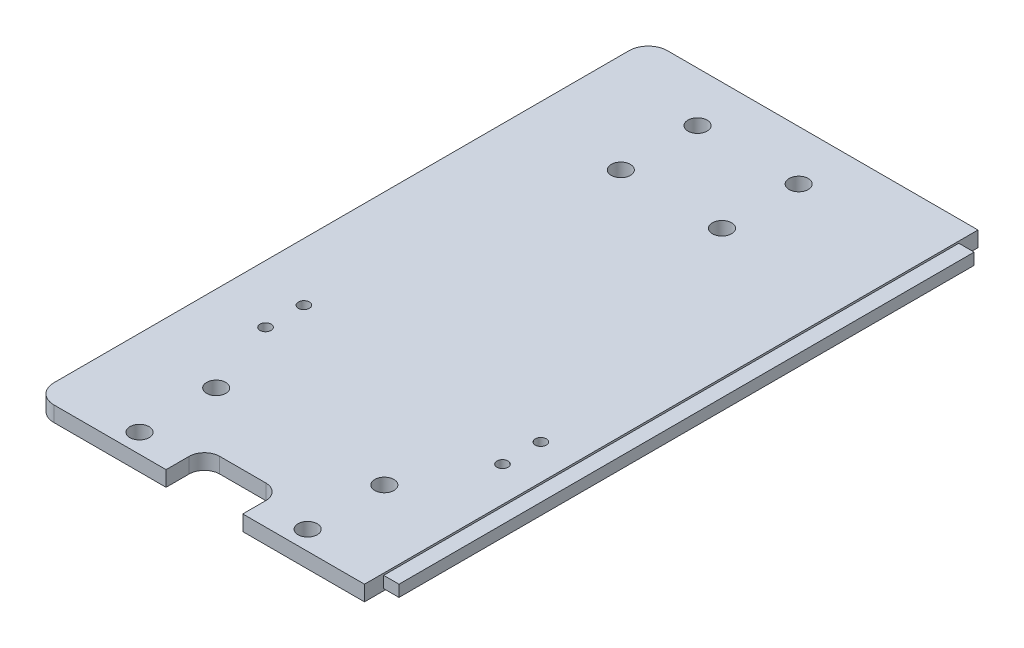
ISO-10303-21;
HEADER;
FILE_DESCRIPTION(('STEP AP214'),'2;1');
FILE_NAME('part.step','',(''),(''),'','','');
FILE_SCHEMA(('AUTOMOTIVE_DESIGN { 1 0 10303 214 1 1 1 1 }'));
ENDSEC;
DATA;
#1=APPLICATION_CONTEXT('core data for automotive mechanical design processes');
#2=APPLICATION_PROTOCOL_DEFINITION('international standard','automotive_design',2000,#1);
#3=PRODUCT_CONTEXT('',#1,'mechanical');
#4=PRODUCT('Part','Part','',(#3));
#5=PRODUCT_RELATED_PRODUCT_CATEGORY('part','',(#4));
#6=PRODUCT_DEFINITION_FORMATION('','',#4);
#7=PRODUCT_DEFINITION_CONTEXT('part definition',#1,'design');
#8=PRODUCT_DEFINITION('design','',#6,#7);
#9=PRODUCT_DEFINITION_SHAPE('','',#8);
#10=(LENGTH_UNIT() NAMED_UNIT(*) SI_UNIT(.MILLI.,.METRE.));
#11=(NAMED_UNIT(*) PLANE_ANGLE_UNIT() SI_UNIT($,.RADIAN.));
#12=(NAMED_UNIT(*) SI_UNIT($,.STERADIAN.) SOLID_ANGLE_UNIT());
#13=UNCERTAINTY_MEASURE_WITH_UNIT(LENGTH_MEASURE(1.E-05),#10,'distance_accuracy_value','');
#14=(GEOMETRIC_REPRESENTATION_CONTEXT(3) GLOBAL_UNCERTAINTY_ASSIGNED_CONTEXT((#13)) GLOBAL_UNIT_ASSIGNED_CONTEXT((#10,
#11,#12)) REPRESENTATION_CONTEXT('',''));
#15=CARTESIAN_POINT('',(0.,0.,0.));
#16=DIRECTION('',(0.,0.,1.));
#17=DIRECTION('',(1.,0.,0.));
#18=AXIS2_PLACEMENT_3D('',#15,#16,#17);
#19=CARTESIAN_POINT('',(109.22,12.7,0.));
#20=DIRECTION('',(-1.,0.,0.));
#21=DIRECTION('',(0.,-1.,0.));
#22=AXIS2_PLACEMENT_3D('',#19,#20,#21);
#23=PLANE('',#22);
#24=DIRECTION('',(0.,1.,0.));
#25=VECTOR('',#24,1.);
#26=CARTESIAN_POINT('',(109.22,0.,203.2));
#27=LINE('',#26,#25);
#28=CARTESIAN_POINT('',(109.22,-2.53999999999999,203.2));
#29=VERTEX_POINT('',#28);
#30=CARTESIAN_POINT('',(109.22,2.54000000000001,203.2));
#31=VERTEX_POINT('',#30);
#32=EDGE_CURVE('E236',#29,#31,#27,.T.);
#33=ORIENTED_EDGE('',*,*,#32,.F.);
#34=DIRECTION('',(0.,0.,-1.));
#35=VECTOR('',#34,1.);
#36=CARTESIAN_POINT('',(109.22,-2.53999999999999,203.2));
#37=LINE('',#36,#35);
#38=CARTESIAN_POINT('',(109.22,-2.53999999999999,0.));
#39=VERTEX_POINT('',#38);
#40=EDGE_CURVE('E184',#39,#29,#37,.F.);
#41=ORIENTED_EDGE('',*,*,#40,.F.);
#42=DIRECTION('',(0.,-1.,0.));
#43=VECTOR('',#42,1.);
#44=CARTESIAN_POINT('',(109.22,12.7,0.));
#45=LINE('',#44,#43);
#46=CARTESIAN_POINT('',(109.22,2.54000000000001,0.));
#47=VERTEX_POINT('',#46);
#48=EDGE_CURVE('E38',#47,#39,#45,.T.);
#49=ORIENTED_EDGE('',*,*,#48,.F.);
#50=DIRECTION('',(0.,0.,-1.));
#51=VECTOR('',#50,1.);
#52=CARTESIAN_POINT('',(109.22,2.54000000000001,-12.7));
#53=LINE('',#52,#51);
#54=EDGE_CURVE('E224',#31,#47,#53,.T.);
#55=ORIENTED_EDGE('',*,*,#54,.F.);
#56=EDGE_LOOP('',(#33,#41,#49,#55));
#57=FACE_BOUND('',#56,.T.);
#58=DIRECTION('',(0.,1.,0.));
#59=VECTOR('',#58,1.);
#60=CARTESIAN_POINT('',(109.22,-1.90499999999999,6.34999999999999));
#61=LINE('',#60,#59);
#62=CARTESIAN_POINT('',(109.22,-1.90499999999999,6.34999999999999));
#63=VERTEX_POINT('',#62);
#64=CARTESIAN_POINT('',(109.22,1.90500000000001,6.35));
#65=VERTEX_POINT('',#64);
#66=EDGE_CURVE('E51',#63,#65,#61,.T.);
#67=ORIENTED_EDGE('',*,*,#66,.F.);
#68=DIRECTION('',(0.,0.,-1.));
#69=VECTOR('',#68,1.);
#70=CARTESIAN_POINT('',(109.22,-1.90499999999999,196.85));
#71=LINE('',#70,#69);
#72=CARTESIAN_POINT('',(109.22,-1.90499999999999,196.85));
#73=VERTEX_POINT('',#72);
#74=EDGE_CURVE('E55',#73,#63,#71,.T.);
#75=ORIENTED_EDGE('',*,*,#74,.F.);
#76=DIRECTION('',(0.,-1.,0.));
#77=VECTOR('',#76,1.);
#78=CARTESIAN_POINT('',(109.22,-1.90499999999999,196.85));
#79=LINE('',#78,#77);
#80=CARTESIAN_POINT('',(109.22,1.90500000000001,196.85));
#81=VERTEX_POINT('',#80);
#82=EDGE_CURVE('E541',#81,#73,#79,.T.);
#83=ORIENTED_EDGE('',*,*,#82,.F.);
#84=DIRECTION('',(0.,0.,1.));
#85=VECTOR('',#84,1.);
#86=CARTESIAN_POINT('',(109.22,1.90500000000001,196.85));
#87=LINE('',#86,#85);
#88=EDGE_CURVE('E547',#65,#81,#87,.T.);
#89=ORIENTED_EDGE('',*,*,#88,.F.);
#90=EDGE_LOOP('',(#67,#75,#83,#89));
#91=FACE_BOUND('',#90,.T.);
#92=ADVANCED_FACE('F35',(#57,#91),#23,.F.);
#93=CARTESIAN_POINT('',(0.,0.,0.));
#94=DIRECTION('',(0.,0.,-1.));
#95=DIRECTION('',(-1.,0.,0.));
#96=AXIS2_PLACEMENT_3D('',#93,#94,#95);
#97=PLANE('',#96);
#98=ORIENTED_EDGE('',*,*,#48,.T.);
#99=DIRECTION('',(1.,0.,0.));
#100=VECTOR('',#99,1.);
#101=CARTESIAN_POINT('',(127.,-2.53999999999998,0.));
#102=LINE('',#101,#100);
#103=CARTESIAN_POINT('',(6.34999999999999,-2.54,0.));
#104=VERTEX_POINT('',#103);
#105=EDGE_CURVE('E223',#104,#39,#102,.T.);
#106=ORIENTED_EDGE('',*,*,#105,.F.);
#107=DIRECTION('',(0.,1.,0.));
#108=VECTOR('',#107,1.);
#109=CARTESIAN_POINT('',(6.35,2.54,0.));
#110=LINE('',#109,#108);
#111=CARTESIAN_POINT('',(6.34999999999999,2.54,0.));
#112=VERTEX_POINT('',#111);
#113=EDGE_CURVE('E170',#104,#112,#110,.T.);
#114=ORIENTED_EDGE('',*,*,#113,.T.);
#115=DIRECTION('',(-1.,0.,0.));
#116=VECTOR('',#115,1.);
#117=CARTESIAN_POINT('',(127.,2.54000000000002,0.));
#118=LINE('',#117,#116);
#119=EDGE_CURVE('E216',#47,#112,#118,.T.);
#120=ORIENTED_EDGE('',*,*,#119,.F.);
#121=EDGE_LOOP('',(#98,#106,#114,#120));
#122=FACE_BOUND('',#121,.T.);
#123=ADVANCED_FACE('F341',(#122),#97,.T.);
#124=CARTESIAN_POINT('',(127.,2.54000000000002,203.2));
#125=DIRECTION('',(0.,-1.,0.));
#126=DIRECTION('',(1.,0.,0.));
#127=AXIS2_PLACEMENT_3D('',#124,#125,#126);
#128=PLANE('',#127);
#129=CARTESIAN_POINT('',(19.144,2.54,133.2));
#130=DIRECTION('',(0.,1.,0.));
#131=DIRECTION('',(-1.,0.,0.));
#132=AXIS2_PLACEMENT_3D('',#129,#130,#131);
#133=CIRCLE('',#132,1.8288);
#134=CARTESIAN_POINT('',(17.3152,2.54000000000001,133.2));
#135=VERTEX_POINT('',#134);
#136=EDGE_CURVE('E235',#135,#135,#133,.T.);
#137=ORIENTED_EDGE('',*,*,#136,.F.);
#138=EDGE_LOOP('',(#137));
#139=FACE_BOUND('',#138,.T.);
#140=CARTESIAN_POINT('',(19.144,2.54,145.9));
#141=DIRECTION('',(0.,1.,0.));
#142=DIRECTION('',(-1.,0.,0.));
#143=AXIS2_PLACEMENT_3D('',#140,#141,#142);
#144=CIRCLE('',#143,1.8288);
#145=CARTESIAN_POINT('',(17.3152,2.54000000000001,145.9));
#146=VERTEX_POINT('',#145);
#147=EDGE_CURVE('E256',#146,#146,#144,.T.);
#148=ORIENTED_EDGE('',*,*,#147,.F.);
#149=EDGE_LOOP('',(#148));
#150=FACE_BOUND('',#149,.T.);
#151=CARTESIAN_POINT('',(97.63,2.54000000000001,145.9));
#152=DIRECTION('',(0.,1.,0.));
#153=DIRECTION('',(-1.,0.,0.));
#154=AXIS2_PLACEMENT_3D('',#151,#152,#153);
#155=CIRCLE('',#154,1.8288);
#156=CARTESIAN_POINT('',(95.8012,2.54000000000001,145.9));
#157=VERTEX_POINT('',#156);
#158=EDGE_CURVE('E252',#157,#157,#155,.T.);
#159=ORIENTED_EDGE('',*,*,#158,.F.);
#160=EDGE_LOOP('',(#159));
#161=FACE_BOUND('',#160,.T.);
#162=CARTESIAN_POINT('',(97.63,2.54000000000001,133.2));
#163=DIRECTION('',(0.,1.,0.));
#164=DIRECTION('',(-1.,0.,0.));
#165=AXIS2_PLACEMENT_3D('',#162,#163,#164);
#166=CIRCLE('',#165,1.8288);
#167=CARTESIAN_POINT('',(95.8012,2.54000000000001,133.2));
#168=VERTEX_POINT('',#167);
#169=EDGE_CURVE('E255',#168,#168,#166,.T.);
#170=ORIENTED_EDGE('',*,*,#169,.F.);
#171=EDGE_LOOP('',(#170));
#172=FACE_BOUND('',#171,.T.);
#173=CARTESIAN_POINT('',(66.33845,2.53999999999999,41.91));
#174=DIRECTION('',(0.,-1.,0.));
#175=DIRECTION('',(1.,0.,0.));
#176=AXIS2_PLACEMENT_3D('',#173,#174,#175);
#177=CIRCLE('',#176,3.175);
#178=CARTESIAN_POINT('',(69.51345,2.53999999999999,41.91));
#179=VERTEX_POINT('',#178);
#180=EDGE_CURVE('E205',#179,#179,#177,.T.);
#181=ORIENTED_EDGE('',*,*,#180,.T.);
#182=EDGE_LOOP('',(#181));
#183=FACE_BOUND('',#182,.T.);
#184=CARTESIAN_POINT('',(66.33845,2.53999999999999,16.51));
#185=DIRECTION('',(0.,-1.,0.));
#186=DIRECTION('',(1.,0.,0.));
#187=AXIS2_PLACEMENT_3D('',#184,#185,#186);
#188=CIRCLE('',#187,3.175);
#189=CARTESIAN_POINT('',(69.51345,2.53999999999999,16.51));
#190=VERTEX_POINT('',#189);
#191=EDGE_CURVE('E266',#190,#190,#188,.T.);
#192=ORIENTED_EDGE('',*,*,#191,.T.);
#193=EDGE_LOOP('',(#192));
#194=FACE_BOUND('',#193,.T.);
#195=CARTESIAN_POINT('',(32.832800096,2.54,41.91));
#196=DIRECTION('',(0.,-1.,0.));
#197=DIRECTION('',(1.,0.,0.));
#198=AXIS2_PLACEMENT_3D('',#195,#196,#197);
#199=CIRCLE('',#198,3.175);
#200=CARTESIAN_POINT('',(36.007800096,2.54,41.91));
#201=VERTEX_POINT('',#200);
#202=EDGE_CURVE('E272',#201,#201,#199,.T.);
#203=ORIENTED_EDGE('',*,*,#202,.T.);
#204=EDGE_LOOP('',(#203));
#205=FACE_BOUND('',#204,.T.);
#206=CARTESIAN_POINT('',(32.832800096,2.54,16.51));
#207=DIRECTION('',(0.,-1.,0.));
#208=DIRECTION('',(1.,0.,0.));
#209=AXIS2_PLACEMENT_3D('',#206,#207,#208);
#210=CIRCLE('',#209,3.175);
#211=CARTESIAN_POINT('',(36.007800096,2.54,16.51));
#212=VERTEX_POINT('',#211);
#213=EDGE_CURVE('E281',#212,#212,#210,.T.);
#214=ORIENTED_EDGE('',*,*,#213,.T.);
#215=EDGE_LOOP('',(#214));
#216=FACE_BOUND('',#215,.T.);
#217=CARTESIAN_POINT('',(84.0486,2.54000000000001,171.45));
#218=DIRECTION('',(0.,1.,0.));
#219=DIRECTION('',(-1.,0.,0.));
#220=AXIS2_PLACEMENT_3D('',#217,#218,#219);
#221=CIRCLE('',#220,3.175);
#222=CARTESIAN_POINT('',(80.8736,2.54000000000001,171.45));
#223=VERTEX_POINT('',#222);
#224=EDGE_CURVE('E275',#223,#223,#221,.T.);
#225=ORIENTED_EDGE('',*,*,#224,.F.);
#226=EDGE_LOOP('',(#225));
#227=FACE_BOUND('',#226,.T.);
#228=CARTESIAN_POINT('',(84.0486,2.54000000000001,196.85));
#229=DIRECTION('',(0.,1.,0.));
#230=DIRECTION('',(-1.,0.,0.));
#231=AXIS2_PLACEMENT_3D('',#228,#229,#230);
#232=CIRCLE('',#231,3.175);
#233=CARTESIAN_POINT('',(80.8736,2.54000000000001,196.85));
#234=VERTEX_POINT('',#233);
#235=EDGE_CURVE('E290',#234,#234,#232,.T.);
#236=ORIENTED_EDGE('',*,*,#235,.F.);
#237=EDGE_LOOP('',(#236));
#238=FACE_BOUND('',#237,.T.);
#239=CARTESIAN_POINT('',(28.3573998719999,2.54,196.85));
#240=DIRECTION('',(0.,-1.,0.));
#241=DIRECTION('',(1.,0.,0.));
#242=AXIS2_PLACEMENT_3D('',#239,#240,#241);
#243=CIRCLE('',#242,3.175);
#244=CARTESIAN_POINT('',(31.5323998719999,2.54,196.85));
#245=VERTEX_POINT('',#244);
#246=EDGE_CURVE('E287',#245,#245,#243,.T.);
#247=ORIENTED_EDGE('',*,*,#246,.T.);
#248=EDGE_LOOP('',(#247));
#249=FACE_BOUND('',#248,.T.);
#250=CARTESIAN_POINT('',(28.3573998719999,2.54,171.45));
#251=DIRECTION('',(0.,-1.,0.));
#252=DIRECTION('',(1.,0.,0.));
#253=AXIS2_PLACEMENT_3D('',#250,#251,#252);
#254=CIRCLE('',#253,3.175);
#255=CARTESIAN_POINT('',(31.5323998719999,2.54,171.45));
#256=VERTEX_POINT('',#255);
#257=EDGE_CURVE('E227',#256,#256,#254,.T.);
#258=ORIENTED_EDGE('',*,*,#257,.T.);
#259=EDGE_LOOP('',(#258));
#260=FACE_BOUND('',#259,.T.);
#261=ORIENTED_EDGE('',*,*,#54,.T.);
#262=ORIENTED_EDGE('',*,*,#119,.T.);
#263=CARTESIAN_POINT('',(6.35,2.54,6.35));
#264=DIRECTION('',(0.,-1.,0.));
#265=DIRECTION('',(1.,0.,0.));
#266=AXIS2_PLACEMENT_3D('',#263,#264,#265);
#267=CIRCLE('',#266,6.35);
#268=CARTESIAN_POINT('',(0.,2.54,6.34999999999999));
#269=VERTEX_POINT('',#268);
#270=EDGE_CURVE('E214',#112,#269,#267,.F.);
#271=ORIENTED_EDGE('',*,*,#270,.T.);
#272=DIRECTION('',(0.,0.,-1.));
#273=VECTOR('',#272,1.);
#274=CARTESIAN_POINT('',(0.,2.54,203.2));
#275=LINE('',#274,#273);
#276=CARTESIAN_POINT('',(0.,2.54,196.85));
#277=VERTEX_POINT('',#276);
#278=EDGE_CURVE('E43',#277,#269,#275,.T.);
#279=ORIENTED_EDGE('',*,*,#278,.F.);
#280=CARTESIAN_POINT('',(6.35,2.54,196.85));
#281=DIRECTION('',(0.,-1.,0.));
#282=DIRECTION('',(1.,0.,0.));
#283=AXIS2_PLACEMENT_3D('',#280,#281,#282);
#284=CIRCLE('',#283,6.35);
#285=CARTESIAN_POINT('',(6.34999999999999,2.54,203.2));
#286=VERTEX_POINT('',#285);
#287=EDGE_CURVE('E182',#277,#286,#284,.F.);
#288=ORIENTED_EDGE('',*,*,#287,.T.);
#289=DIRECTION('',(-1.,0.,0.));
#290=VECTOR('',#289,1.);
#291=CARTESIAN_POINT('',(127.,2.54000000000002,203.2));
#292=LINE('',#291,#290);
#293=CARTESIAN_POINT('',(43.502999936,2.54000000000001,203.2));
#294=VERTEX_POINT('',#293);
#295=EDGE_CURVE('E186',#294,#286,#292,.T.);
#296=ORIENTED_EDGE('',*,*,#295,.F.);
#297=DIRECTION('',(0.,0.,1.));
#298=VECTOR('',#297,1.);
#299=CARTESIAN_POINT('',(43.502999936,2.54000000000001,203.2));
#300=LINE('',#299,#298);
#301=CARTESIAN_POINT('',(43.502999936,2.54000000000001,195.58));
#302=VERTEX_POINT('',#301);
#303=EDGE_CURVE('E190',#302,#294,#300,.T.);
#304=ORIENTED_EDGE('',*,*,#303,.F.);
#305=CARTESIAN_POINT('',(48.582999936,2.54000000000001,195.58));
#306=DIRECTION('',(0.,-1.,0.));
#307=DIRECTION('',(1.,0.,0.));
#308=AXIS2_PLACEMENT_3D('',#305,#306,#307);
#309=CIRCLE('',#308,5.08);
#310=CARTESIAN_POINT('',(48.582999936,2.54000000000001,190.5));
#311=VERTEX_POINT('',#310);
#312=EDGE_CURVE('E179',#302,#311,#309,.T.);
#313=ORIENTED_EDGE('',*,*,#312,.T.);
#314=DIRECTION('',(-1.,0.,0.));
#315=VECTOR('',#314,1.);
#316=CARTESIAN_POINT('',(43.502999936,2.54000000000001,190.5));
#317=LINE('',#316,#315);
#318=CARTESIAN_POINT('',(63.822999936,2.54000000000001,190.5));
#319=VERTEX_POINT('',#318);
#320=EDGE_CURVE('E199',#319,#311,#317,.T.);
#321=ORIENTED_EDGE('',*,*,#320,.F.);
#322=CARTESIAN_POINT('',(63.822999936,2.54000000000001,195.58));
#323=DIRECTION('',(0.,-1.,0.));
#324=DIRECTION('',(1.,0.,0.));
#325=AXIS2_PLACEMENT_3D('',#322,#323,#324);
#326=CIRCLE('',#325,5.08);
#327=CARTESIAN_POINT('',(68.902999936,2.54000000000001,195.58));
#328=VERTEX_POINT('',#327);
#329=EDGE_CURVE('E181',#319,#328,#326,.T.);
#330=ORIENTED_EDGE('',*,*,#329,.T.);
#331=DIRECTION('',(0.,0.,-1.));
#332=VECTOR('',#331,1.);
#333=CARTESIAN_POINT('',(68.902999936,2.54000000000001,203.2));
#334=LINE('',#333,#332);
#335=CARTESIAN_POINT('',(68.902999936,2.54000000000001,203.2));
#336=VERTEX_POINT('',#335);
#337=EDGE_CURVE('E195',#336,#328,#334,.T.);
#338=ORIENTED_EDGE('',*,*,#337,.F.);
#339=EDGE_CURVE('E233',#31,#336,#292,.T.);
#340=ORIENTED_EDGE('',*,*,#339,.F.);
#341=EDGE_LOOP('',(#261,#262,#271,#279,#288,#296,#304,#313,#321,#330,#338,#340));
#342=FACE_BOUND('',#341,.T.);
#343=ADVANCED_FACE('F344',(#139,#150,#161,#172,#183,#194,#205,#216,#227,#238,#249,#260,#342),
#128,.F.);
#344=CARTESIAN_POINT('',(0.,0.,203.2));
#345=DIRECTION('',(0.,0.,-1.));
#346=DIRECTION('',(-1.,0.,0.));
#347=AXIS2_PLACEMENT_3D('',#344,#345,#346);
#348=PLANE('',#347);
#349=ORIENTED_EDGE('',*,*,#295,.T.);
#350=DIRECTION('',(0.,1.,0.));
#351=VECTOR('',#350,1.);
#352=CARTESIAN_POINT('',(6.35,0.,203.2));
#353=LINE('',#352,#351);
#354=CARTESIAN_POINT('',(6.34999999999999,-2.54,203.2));
#355=VERTEX_POINT('',#354);
#356=EDGE_CURVE('E210',#286,#355,#353,.F.);
#357=ORIENTED_EDGE('',*,*,#356,.T.);
#358=DIRECTION('',(1.,0.,0.));
#359=VECTOR('',#358,1.);
#360=CARTESIAN_POINT('',(127.,-2.53999999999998,203.2));
#361=LINE('',#360,#359);
#362=CARTESIAN_POINT('',(43.502999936,-2.53999999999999,203.2));
#363=VERTEX_POINT('',#362);
#364=EDGE_CURVE('E212',#355,#363,#361,.T.);
#365=ORIENTED_EDGE('',*,*,#364,.T.);
#366=DIRECTION('',(0.,1.,0.));
#367=VECTOR('',#366,1.);
#368=CARTESIAN_POINT('',(43.502999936,-2.54100000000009,203.2));
#369=LINE('',#368,#367);
#370=EDGE_CURVE('E232',#363,#294,#369,.T.);
#371=ORIENTED_EDGE('',*,*,#370,.T.);
#372=EDGE_LOOP('',(#349,#357,#365,#371));
#373=FACE_BOUND('',#372,.T.);
#374=ADVANCED_FACE('F370',(#373),#348,.F.);
#375=CARTESIAN_POINT('',(127.,-2.53999999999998,203.2));
#376=DIRECTION('',(0.,1.,0.));
#377=DIRECTION('',(-1.,0.,0.));
#378=AXIS2_PLACEMENT_3D('',#375,#376,#377);
#379=PLANE('',#378);
#380=ORIENTED_EDGE('',*,*,#105,.T.);
#381=ORIENTED_EDGE('',*,*,#40,.T.);
#382=CARTESIAN_POINT('',(68.902999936,-2.53999999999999,203.2));
#383=VERTEX_POINT('',#382);
#384=EDGE_CURVE('E238',#383,#29,#361,.T.);
#385=ORIENTED_EDGE('',*,*,#384,.F.);
#386=DIRECTION('',(0.,0.,1.));
#387=VECTOR('',#386,1.);
#388=CARTESIAN_POINT('',(68.902999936,-2.53999999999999,203.2));
#389=LINE('',#388,#387);
#390=CARTESIAN_POINT('',(68.902999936,-2.53999999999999,195.58));
#391=VERTEX_POINT('',#390);
#392=EDGE_CURVE('E194',#391,#383,#389,.T.);
#393=ORIENTED_EDGE('',*,*,#392,.F.);
#394=CARTESIAN_POINT('',(63.822999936,-2.53999999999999,195.58));
#395=DIRECTION('',(0.,1.,0.));
#396=DIRECTION('',(-1.,0.,0.));
#397=AXIS2_PLACEMENT_3D('',#394,#395,#396);
#398=CIRCLE('',#397,5.08);
#399=CARTESIAN_POINT('',(63.822999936,-2.53999999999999,190.5));
#400=VERTEX_POINT('',#399);
#401=EDGE_CURVE('E178',#391,#400,#398,.T.);
#402=ORIENTED_EDGE('',*,*,#401,.T.);
#403=DIRECTION('',(1.,0.,0.));
#404=VECTOR('',#403,1.);
#405=CARTESIAN_POINT('',(43.502999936,-2.53999999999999,190.5));
#406=LINE('',#405,#404);
#407=CARTESIAN_POINT('',(48.582999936,-2.53999999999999,190.5));
#408=VERTEX_POINT('',#407);
#409=EDGE_CURVE('E200',#408,#400,#406,.T.);
#410=ORIENTED_EDGE('',*,*,#409,.F.);
#411=CARTESIAN_POINT('',(48.582999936,-2.53999999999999,195.58));
#412=DIRECTION('',(0.,1.,0.));
#413=DIRECTION('',(-1.,0.,0.));
#414=AXIS2_PLACEMENT_3D('',#411,#412,#413);
#415=CIRCLE('',#414,5.08);
#416=CARTESIAN_POINT('',(43.502999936,-2.53999999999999,195.58));
#417=VERTEX_POINT('',#416);
#418=EDGE_CURVE('E175',#408,#417,#415,.T.);
#419=ORIENTED_EDGE('',*,*,#418,.T.);
#420=DIRECTION('',(0.,0.,-1.));
#421=VECTOR('',#420,1.);
#422=CARTESIAN_POINT('',(43.502999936,-2.53999999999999,203.2));
#423=LINE('',#422,#421);
#424=EDGE_CURVE('E191',#363,#417,#423,.T.);
#425=ORIENTED_EDGE('',*,*,#424,.F.);
#426=ORIENTED_EDGE('',*,*,#364,.F.);
#427=CARTESIAN_POINT('',(6.35,-2.54,196.85));
#428=DIRECTION('',(0.,1.,0.));
#429=DIRECTION('',(-1.,0.,0.));
#430=AXIS2_PLACEMENT_3D('',#427,#428,#429);
#431=CIRCLE('',#430,6.35);
#432=CARTESIAN_POINT('',(0.,-2.54,196.85));
#433=VERTEX_POINT('',#432);
#434=EDGE_CURVE('E177',#355,#433,#431,.F.);
#435=ORIENTED_EDGE('',*,*,#434,.T.);
#436=DIRECTION('',(0.,0.,1.));
#437=VECTOR('',#436,1.);
#438=CARTESIAN_POINT('',(0.,-2.54,203.2));
#439=LINE('',#438,#437);
#440=CARTESIAN_POINT('',(0.,-2.54,6.34999999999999));
#441=VERTEX_POINT('',#440);
#442=EDGE_CURVE('E219',#441,#433,#439,.T.);
#443=ORIENTED_EDGE('',*,*,#442,.F.);
#444=CARTESIAN_POINT('',(6.35,-2.54,6.35));
#445=DIRECTION('',(0.,1.,0.));
#446=DIRECTION('',(-1.,0.,0.));
#447=AXIS2_PLACEMENT_3D('',#444,#445,#446);
#448=CIRCLE('',#447,6.35);
#449=EDGE_CURVE('E207',#441,#104,#448,.F.);
#450=ORIENTED_EDGE('',*,*,#449,.T.);
#451=EDGE_LOOP('',(#380,#381,#385,#393,#402,#410,#419,#425,#426,#435,#443,#450));
#452=FACE_BOUND('',#451,.T.);
#453=CARTESIAN_POINT('',(28.3573998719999,-2.54,171.45));
#454=DIRECTION('',(0.,1.,0.));
#455=DIRECTION('',(-1.,0.,0.));
#456=AXIS2_PLACEMENT_3D('',#453,#454,#455);
#457=CIRCLE('',#456,3.175);
#458=CARTESIAN_POINT('',(25.182399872,-2.54,171.45));
#459=VERTEX_POINT('',#458);
#460=EDGE_CURVE('E209',#459,#459,#457,.T.);
#461=ORIENTED_EDGE('',*,*,#460,.T.);
#462=EDGE_LOOP('',(#461));
#463=FACE_BOUND('',#462,.T.);
#464=CARTESIAN_POINT('',(28.3573998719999,-2.54,196.85));
#465=DIRECTION('',(0.,1.,0.));
#466=DIRECTION('',(-1.,0.,0.));
#467=AXIS2_PLACEMENT_3D('',#464,#465,#466);
#468=CIRCLE('',#467,3.175);
#469=CARTESIAN_POINT('',(25.182399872,-2.54,196.85));
#470=VERTEX_POINT('',#469);
#471=EDGE_CURVE('E298',#470,#470,#468,.T.);
#472=ORIENTED_EDGE('',*,*,#471,.T.);
#473=EDGE_LOOP('',(#472));
#474=FACE_BOUND('',#473,.T.);
#475=CARTESIAN_POINT('',(84.0486,-2.54000000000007,196.85));
#476=DIRECTION('',(0.,1.,0.));
#477=DIRECTION('',(-1.,0.,0.));
#478=AXIS2_PLACEMENT_3D('',#475,#476,#477);
#479=CIRCLE('',#478,3.175);
#480=CARTESIAN_POINT('',(80.8736,-2.54000000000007,196.85));
#481=VERTEX_POINT('',#480);
#482=EDGE_CURVE('E293',#481,#481,#479,.T.);
#483=ORIENTED_EDGE('',*,*,#482,.T.);
#484=EDGE_LOOP('',(#483));
#485=FACE_BOUND('',#484,.T.);
#486=CARTESIAN_POINT('',(84.0486,-2.54000000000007,171.45));
#487=DIRECTION('',(0.,1.,0.));
#488=DIRECTION('',(-1.,0.,0.));
#489=AXIS2_PLACEMENT_3D('',#486,#487,#488);
#490=CIRCLE('',#489,3.175);
#491=CARTESIAN_POINT('',(80.8736,-2.54000000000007,171.45));
#492=VERTEX_POINT('',#491);
#493=EDGE_CURVE('E284',#492,#492,#490,.T.);
#494=ORIENTED_EDGE('',*,*,#493,.T.);
#495=EDGE_LOOP('',(#494));
#496=FACE_BOUND('',#495,.T.);
#497=CARTESIAN_POINT('',(32.832800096,-2.54,16.51));
#498=DIRECTION('',(0.,1.,0.));
#499=DIRECTION('',(-1.,0.,0.));
#500=AXIS2_PLACEMENT_3D('',#497,#498,#499);
#501=CIRCLE('',#500,3.175);
#502=CARTESIAN_POINT('',(29.657800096,-2.54,16.51));
#503=VERTEX_POINT('',#502);
#504=EDGE_CURVE('E278',#503,#503,#501,.T.);
#505=ORIENTED_EDGE('',*,*,#504,.T.);
#506=EDGE_LOOP('',(#505));
#507=FACE_BOUND('',#506,.T.);
#508=CARTESIAN_POINT('',(32.832800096,-2.54,41.91));
#509=DIRECTION('',(0.,1.,0.));
#510=DIRECTION('',(-1.,0.,0.));
#511=AXIS2_PLACEMENT_3D('',#508,#509,#510);
#512=CIRCLE('',#511,3.175);
#513=CARTESIAN_POINT('',(29.657800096,-2.54,41.91));
#514=VERTEX_POINT('',#513);
#515=EDGE_CURVE('E243',#514,#514,#512,.T.);
#516=ORIENTED_EDGE('',*,*,#515,.T.);
#517=EDGE_LOOP('',(#516));
#518=FACE_BOUND('',#517,.T.);
#519=CARTESIAN_POINT('',(66.33845,-2.54000000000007,16.51));
#520=DIRECTION('',(0.,-1.,0.));
#521=DIRECTION('',(1.,0.,0.));
#522=AXIS2_PLACEMENT_3D('',#519,#520,#521);
#523=CIRCLE('',#522,3.175);
#524=CARTESIAN_POINT('',(69.51345,-2.54000000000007,16.51));
#525=VERTEX_POINT('',#524);
#526=EDGE_CURVE('E269',#525,#525,#523,.T.);
#527=ORIENTED_EDGE('',*,*,#526,.F.);
#528=EDGE_LOOP('',(#527));
#529=FACE_BOUND('',#528,.T.);
#530=CARTESIAN_POINT('',(66.33845,-2.54000000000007,41.91));
#531=DIRECTION('',(0.,-1.,0.));
#532=DIRECTION('',(1.,0.,0.));
#533=AXIS2_PLACEMENT_3D('',#530,#531,#532);
#534=CIRCLE('',#533,3.175);
#535=CARTESIAN_POINT('',(69.51345,-2.54000000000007,41.91));
#536=VERTEX_POINT('',#535);
#537=EDGE_CURVE('E259',#536,#536,#534,.T.);
#538=ORIENTED_EDGE('',*,*,#537,.F.);
#539=EDGE_LOOP('',(#538));
#540=FACE_BOUND('',#539,.T.);
#541=CARTESIAN_POINT('',(97.63,-2.53999999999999,133.2));
#542=DIRECTION('',(0.,1.,0.));
#543=DIRECTION('',(-1.,0.,0.));
#544=AXIS2_PLACEMENT_3D('',#541,#542,#543);
#545=CIRCLE('',#544,1.8288);
#546=CARTESIAN_POINT('',(95.8012,-2.54000000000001,133.2));
#547=VERTEX_POINT('',#546);
#548=EDGE_CURVE('E239',#547,#547,#545,.T.);
#549=ORIENTED_EDGE('',*,*,#548,.T.);
#550=EDGE_LOOP('',(#549));
#551=FACE_BOUND('',#550,.T.);
#552=CARTESIAN_POINT('',(97.63,-2.53999999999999,145.9));
#553=DIRECTION('',(0.,1.,0.));
#554=DIRECTION('',(-1.,0.,0.));
#555=AXIS2_PLACEMENT_3D('',#552,#553,#554);
#556=CIRCLE('',#555,1.8288);
#557=CARTESIAN_POINT('',(95.8012,-2.54000000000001,145.9));
#558=VERTEX_POINT('',#557);
#559=EDGE_CURVE('E242',#558,#558,#556,.T.);
#560=ORIENTED_EDGE('',*,*,#559,.T.);
#561=EDGE_LOOP('',(#560));
#562=FACE_BOUND('',#561,.T.);
#563=CARTESIAN_POINT('',(19.144,-2.53999999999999,145.9));
#564=DIRECTION('',(0.,1.,0.));
#565=DIRECTION('',(-1.,0.,0.));
#566=AXIS2_PLACEMENT_3D('',#563,#564,#565);
#567=CIRCLE('',#566,1.8288);
#568=CARTESIAN_POINT('',(17.3152,-2.54000000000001,145.9));
#569=VERTEX_POINT('',#568);
#570=EDGE_CURVE('E246',#569,#569,#567,.T.);
#571=ORIENTED_EDGE('',*,*,#570,.T.);
#572=EDGE_LOOP('',(#571));
#573=FACE_BOUND('',#572,.T.);
#574=CARTESIAN_POINT('',(19.144,-2.53999999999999,133.2));
#575=DIRECTION('',(0.,1.,0.));
#576=DIRECTION('',(-1.,0.,0.));
#577=AXIS2_PLACEMENT_3D('',#574,#575,#576);
#578=CIRCLE('',#577,1.8288);
#579=CARTESIAN_POINT('',(17.3152,-2.54000000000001,133.2));
#580=VERTEX_POINT('',#579);
#581=EDGE_CURVE('E249',#580,#580,#578,.T.);
#582=ORIENTED_EDGE('',*,*,#581,.T.);
#583=EDGE_LOOP('',(#582));
#584=FACE_BOUND('',#583,.T.);
#585=ADVANCED_FACE('F334',(#452,#463,#474,#485,#496,#507,#518,#529,#540,#551,#562,#573,#584),
#379,.F.);
#586=ORIENTED_EDGE('',*,*,#384,.T.);
#587=ORIENTED_EDGE('',*,*,#32,.T.);
#588=ORIENTED_EDGE('',*,*,#339,.T.);
#589=DIRECTION('',(0.,1.,0.));
#590=VECTOR('',#589,1.);
#591=CARTESIAN_POINT('',(68.902999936,-2.54100000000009,203.2));
#592=LINE('',#591,#590);
#593=EDGE_CURVE('E309',#383,#336,#592,.T.);
#594=ORIENTED_EDGE('',*,*,#593,.F.);
#595=EDGE_LOOP('',(#586,#587,#588,#594));
#596=FACE_BOUND('',#595,.T.);
#597=ADVANCED_FACE('F331',(#596),#348,.F.);
#598=CARTESIAN_POINT('',(19.144,-149.86,133.2));
#599=DIRECTION('',(0.,1.,0.));
#600=DIRECTION('',(-1.,0.,0.));
#601=AXIS2_PLACEMENT_3D('',#598,#599,#600);
#602=CYLINDRICAL_SURFACE('',#601,1.8288);
#603=CARTESIAN_POINT('',(17.3152,2.54000000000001,133.2));
#604=CARTESIAN_POINT('',(17.3152,2.48708333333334,133.2));
#605=CARTESIAN_POINT('',(17.3152,2.43416666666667,133.2));
#606=CARTESIAN_POINT('',(17.3152,2.32833333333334,133.2));
#607=CARTESIAN_POINT('',(17.3152,2.27541666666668,133.2));
#608=CARTESIAN_POINT('',(17.3152,2.16958333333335,133.2));
#609=CARTESIAN_POINT('',(17.3152,2.11666666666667,133.2));
#610=CARTESIAN_POINT('',(17.3152,2.01083333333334,133.2));
#611=CARTESIAN_POINT('',(17.3152,1.95791666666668,133.2));
#612=CARTESIAN_POINT('',(17.3152,1.85208333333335,133.2));
#613=CARTESIAN_POINT('',(17.3152,1.79916666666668,133.2));
#614=CARTESIAN_POINT('',(17.3152,1.69333333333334,133.2));
#615=CARTESIAN_POINT('',(17.3152,1.64041666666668,133.2));
#616=CARTESIAN_POINT('',(17.3152,1.53458333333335,133.2));
#617=CARTESIAN_POINT('',(17.3152,1.48166666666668,133.2));
#618=CARTESIAN_POINT('',(17.3152,1.37583333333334,133.2));
#619=CARTESIAN_POINT('',(17.3152,1.32291666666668,133.2));
#620=CARTESIAN_POINT('',(17.3152,1.21708333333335,133.2));
#621=CARTESIAN_POINT('',(17.3152,1.16416666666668,133.2));
#622=CARTESIAN_POINT('',(17.3152,1.05833333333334,133.2));
#623=CARTESIAN_POINT('',(17.3152,1.00541666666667,133.2));
#624=CARTESIAN_POINT('',(17.3152,0.899583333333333,133.2));
#625=CARTESIAN_POINT('',(17.3152,0.846666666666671,133.2));
#626=CARTESIAN_POINT('',(17.3152,0.740833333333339,133.2));
#627=CARTESIAN_POINT('',(17.3152,0.687916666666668,133.2));
#628=CARTESIAN_POINT('',(17.3152,0.582083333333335,133.2));
#629=CARTESIAN_POINT('',(17.3152,0.529166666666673,133.2));
#630=CARTESIAN_POINT('',(17.3152,0.42333333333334,133.2));
#631=CARTESIAN_POINT('',(17.3152,0.370416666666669,133.2));
#632=CARTESIAN_POINT('',(17.3152,0.264583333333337,133.2));
#633=CARTESIAN_POINT('',(17.3152,0.211666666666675,133.2));
#634=CARTESIAN_POINT('',(17.3152,0.105833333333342,133.2));
#635=CARTESIAN_POINT('',(17.3152,0.052916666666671,133.2));
#636=CARTESIAN_POINT('',(17.3152,-0.052916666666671,133.2));
#637=CARTESIAN_POINT('',(17.3152,-0.105833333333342,133.2));
#638=CARTESIAN_POINT('',(17.3152,-0.211666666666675,133.2));
#639=CARTESIAN_POINT('',(17.3152,-0.264583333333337,133.2));
#640=CARTESIAN_POINT('',(17.3152,-0.370416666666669,133.2));
#641=CARTESIAN_POINT('',(17.3152,-0.42333333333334,133.2));
#642=CARTESIAN_POINT('',(17.3152,-0.529166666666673,133.2));
#643=CARTESIAN_POINT('',(17.3152,-0.582083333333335,133.2));
#644=CARTESIAN_POINT('',(17.3152,-0.687916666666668,133.2));
#645=CARTESIAN_POINT('',(17.3152,-0.740833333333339,133.2));
#646=CARTESIAN_POINT('',(17.3152,-0.846666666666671,133.2));
#647=CARTESIAN_POINT('',(17.3152,-0.899583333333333,133.2));
#648=CARTESIAN_POINT('',(17.3152,-1.00541666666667,133.2));
#649=CARTESIAN_POINT('',(17.3152,-1.05833333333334,133.2));
#650=CARTESIAN_POINT('',(17.3152,-1.16416666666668,133.2));
#651=CARTESIAN_POINT('',(17.3152,-1.21708333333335,133.2));
#652=CARTESIAN_POINT('',(17.3152,-1.32291666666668,133.2));
#653=CARTESIAN_POINT('',(17.3152,-1.37583333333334,133.2));
#654=CARTESIAN_POINT('',(17.3152,-1.48166666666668,133.2));
#655=CARTESIAN_POINT('',(17.3152,-1.53458333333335,133.2));
#656=CARTESIAN_POINT('',(17.3152,-1.64041666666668,133.2));
#657=CARTESIAN_POINT('',(17.3152,-1.69333333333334,133.2));
#658=CARTESIAN_POINT('',(17.3152,-1.79916666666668,133.2));
#659=CARTESIAN_POINT('',(17.3152,-1.85208333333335,133.2));
#660=CARTESIAN_POINT('',(17.3152,-1.95791666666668,133.2));
#661=CARTESIAN_POINT('',(17.3152,-2.01083333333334,133.2));
#662=CARTESIAN_POINT('',(17.3152,-2.11666666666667,133.2));
#663=CARTESIAN_POINT('',(17.3152,-2.16958333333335,133.2));
#664=CARTESIAN_POINT('',(17.3152,-2.27541666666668,133.2));
#665=CARTESIAN_POINT('',(17.3152,-2.32833333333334,133.2));
#666=CARTESIAN_POINT('',(17.3152,-2.43416666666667,133.2));
#667=CARTESIAN_POINT('',(17.3152,-2.48708333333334,133.2));
#668=CARTESIAN_POINT('',(17.3152,-2.54000000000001,133.2));
#669=B_SPLINE_CURVE_WITH_KNOTS('',3,(#603,#604,#605,#606,#607,#608,#609,#610,#611,#612,#613,
#614,#615,#616,#617,#618,#619,#620,#621,#622,#623,#624,#625,#626,#627,#628,#629,#630,#631,#632,
#633,#634,#635,#636,#637,#638,#639,#640,#641,#642,#643,#644,#645,#646,#647,#648,#649,#650,#651,
#652,#653,#654,#655,#656,#657,#658,#659,#660,#661,#662,#663,#664,#665,#666,#667,#668),
.UNSPECIFIED.,.F.,.F.,(4,2,2,2,2,2,2,2,2,2,2,2,2,2,2,2,2,2,2,2,2,2,2,2,2,2,2,2,2,2,2,2,4),(0.,
0.158750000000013,0.317499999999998,0.476250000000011,0.634999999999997,0.79375000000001,
0.952499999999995,1.11125000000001,1.26999999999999,1.42875000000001,1.58750000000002,1.74625,
1.90500000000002,2.06375,2.22250000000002,2.38125,2.54000000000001,2.69875000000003,
2.85750000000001,3.01625000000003,3.17500000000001,3.33375000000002,3.49250000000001,
3.65125000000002,3.81000000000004,3.96875000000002,4.12750000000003,4.28625000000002,
4.44500000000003,4.60375000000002,4.76250000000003,4.92125000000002,5.08000000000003),.UNSPECIFIED.);
#670=EDGE_CURVE('BSEAM406',#135,#580,#669,.T.);
#671=ORIENTED_EDGE('',*,*,#136,.T.);
#672=ORIENTED_EDGE('',*,*,#581,.F.);
#673=ORIENTED_EDGE('',*,*,#670,.T.);
#674=ORIENTED_EDGE('',*,*,#670,.F.);
#675=EDGE_LOOP('',(#671,#673,#672,#674));
#676=FACE_BOUND('',#675,.T.);
#677=ADVANCED_FACE('F406',(#676),#602,.F.);
#678=CARTESIAN_POINT('',(19.144,-149.86,145.9));
#679=DIRECTION('',(0.,1.,0.));
#680=DIRECTION('',(-1.,0.,0.));
#681=AXIS2_PLACEMENT_3D('',#678,#679,#680);
#682=CYLINDRICAL_SURFACE('',#681,1.8288);
#683=CARTESIAN_POINT('',(17.3152,2.54000000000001,145.9));
#684=CARTESIAN_POINT('',(17.3152,2.48708333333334,145.9));
#685=CARTESIAN_POINT('',(17.3152,2.43416666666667,145.9));
#686=CARTESIAN_POINT('',(17.3152,2.32833333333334,145.9));
#687=CARTESIAN_POINT('',(17.3152,2.27541666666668,145.9));
#688=CARTESIAN_POINT('',(17.3152,2.16958333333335,145.9));
#689=CARTESIAN_POINT('',(17.3152,2.11666666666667,145.9));
#690=CARTESIAN_POINT('',(17.3152,2.01083333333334,145.9));
#691=CARTESIAN_POINT('',(17.3152,1.95791666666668,145.9));
#692=CARTESIAN_POINT('',(17.3152,1.85208333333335,145.9));
#693=CARTESIAN_POINT('',(17.3152,1.79916666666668,145.9));
#694=CARTESIAN_POINT('',(17.3152,1.69333333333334,145.9));
#695=CARTESIAN_POINT('',(17.3152,1.64041666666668,145.9));
#696=CARTESIAN_POINT('',(17.3152,1.53458333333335,145.9));
#697=CARTESIAN_POINT('',(17.3152,1.48166666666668,145.9));
#698=CARTESIAN_POINT('',(17.3152,1.37583333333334,145.9));
#699=CARTESIAN_POINT('',(17.3152,1.32291666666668,145.9));
#700=CARTESIAN_POINT('',(17.3152,1.21708333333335,145.9));
#701=CARTESIAN_POINT('',(17.3152,1.16416666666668,145.9));
#702=CARTESIAN_POINT('',(17.3152,1.05833333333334,145.9));
#703=CARTESIAN_POINT('',(17.3152,1.00541666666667,145.9));
#704=CARTESIAN_POINT('',(17.3152,0.899583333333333,145.9));
#705=CARTESIAN_POINT('',(17.3152,0.846666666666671,145.9));
#706=CARTESIAN_POINT('',(17.3152,0.740833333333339,145.9));
#707=CARTESIAN_POINT('',(17.3152,0.687916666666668,145.9));
#708=CARTESIAN_POINT('',(17.3152,0.582083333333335,145.9));
#709=CARTESIAN_POINT('',(17.3152,0.529166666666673,145.9));
#710=CARTESIAN_POINT('',(17.3152,0.42333333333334,145.9));
#711=CARTESIAN_POINT('',(17.3152,0.370416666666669,145.9));
#712=CARTESIAN_POINT('',(17.3152,0.264583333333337,145.9));
#713=CARTESIAN_POINT('',(17.3152,0.211666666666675,145.9));
#714=CARTESIAN_POINT('',(17.3152,0.105833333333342,145.9));
#715=CARTESIAN_POINT('',(17.3152,0.052916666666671,145.9));
#716=CARTESIAN_POINT('',(17.3152,-0.052916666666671,145.9));
#717=CARTESIAN_POINT('',(17.3152,-0.105833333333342,145.9));
#718=CARTESIAN_POINT('',(17.3152,-0.211666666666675,145.9));
#719=CARTESIAN_POINT('',(17.3152,-0.264583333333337,145.9));
#720=CARTESIAN_POINT('',(17.3152,-0.370416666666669,145.9));
#721=CARTESIAN_POINT('',(17.3152,-0.42333333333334,145.9));
#722=CARTESIAN_POINT('',(17.3152,-0.529166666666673,145.9));
#723=CARTESIAN_POINT('',(17.3152,-0.582083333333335,145.9));
#724=CARTESIAN_POINT('',(17.3152,-0.687916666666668,145.9));
#725=CARTESIAN_POINT('',(17.3152,-0.740833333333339,145.9));
#726=CARTESIAN_POINT('',(17.3152,-0.846666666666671,145.9));
#727=CARTESIAN_POINT('',(17.3152,-0.899583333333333,145.9));
#728=CARTESIAN_POINT('',(17.3152,-1.00541666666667,145.9));
#729=CARTESIAN_POINT('',(17.3152,-1.05833333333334,145.9));
#730=CARTESIAN_POINT('',(17.3152,-1.16416666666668,145.9));
#731=CARTESIAN_POINT('',(17.3152,-1.21708333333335,145.9));
#732=CARTESIAN_POINT('',(17.3152,-1.32291666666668,145.9));
#733=CARTESIAN_POINT('',(17.3152,-1.37583333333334,145.9));
#734=CARTESIAN_POINT('',(17.3152,-1.48166666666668,145.9));
#735=CARTESIAN_POINT('',(17.3152,-1.53458333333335,145.9));
#736=CARTESIAN_POINT('',(17.3152,-1.64041666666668,145.9));
#737=CARTESIAN_POINT('',(17.3152,-1.69333333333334,145.9));
#738=CARTESIAN_POINT('',(17.3152,-1.79916666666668,145.9));
#739=CARTESIAN_POINT('',(17.3152,-1.85208333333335,145.9));
#740=CARTESIAN_POINT('',(17.3152,-1.95791666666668,145.9));
#741=CARTESIAN_POINT('',(17.3152,-2.01083333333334,145.9));
#742=CARTESIAN_POINT('',(17.3152,-2.11666666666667,145.9));
#743=CARTESIAN_POINT('',(17.3152,-2.16958333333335,145.9));
#744=CARTESIAN_POINT('',(17.3152,-2.27541666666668,145.9));
#745=CARTESIAN_POINT('',(17.3152,-2.32833333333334,145.9));
#746=CARTESIAN_POINT('',(17.3152,-2.43416666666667,145.9));
#747=CARTESIAN_POINT('',(17.3152,-2.48708333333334,145.9));
#748=CARTESIAN_POINT('',(17.3152,-2.54000000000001,145.9));
#749=B_SPLINE_CURVE_WITH_KNOTS('',3,(#683,#684,#685,#686,#687,#688,#689,#690,#691,#692,#693,
#694,#695,#696,#697,#698,#699,#700,#701,#702,#703,#704,#705,#706,#707,#708,#709,#710,#711,#712,
#713,#714,#715,#716,#717,#718,#719,#720,#721,#722,#723,#724,#725,#726,#727,#728,#729,#730,#731,
#732,#733,#734,#735,#736,#737,#738,#739,#740,#741,#742,#743,#744,#745,#746,#747,#748),
.UNSPECIFIED.,.F.,.F.,(4,2,2,2,2,2,2,2,2,2,2,2,2,2,2,2,2,2,2,2,2,2,2,2,2,2,2,2,2,2,2,2,4),(0.,
0.158750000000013,0.317499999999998,0.476250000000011,0.634999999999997,0.79375000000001,
0.952499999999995,1.11125000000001,1.26999999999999,1.42875000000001,1.58750000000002,1.74625,
1.90500000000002,2.06375,2.22250000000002,2.38125,2.54000000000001,2.69875000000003,
2.85750000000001,3.01625000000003,3.17500000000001,3.33375000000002,3.49250000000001,
3.65125000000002,3.81000000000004,3.96875000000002,4.12750000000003,4.28625000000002,
4.44500000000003,4.60375000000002,4.76250000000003,4.92125000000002,5.08000000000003),.UNSPECIFIED.);
#750=EDGE_CURVE('BSEAM411',#146,#569,#749,.T.);
#751=ORIENTED_EDGE('',*,*,#147,.T.);
#752=ORIENTED_EDGE('',*,*,#570,.F.);
#753=ORIENTED_EDGE('',*,*,#750,.T.);
#754=ORIENTED_EDGE('',*,*,#750,.F.);
#755=EDGE_LOOP('',(#751,#753,#752,#754));
#756=FACE_BOUND('',#755,.T.);
#757=ADVANCED_FACE('F411',(#756),#682,.F.);
#758=CARTESIAN_POINT('',(97.63,-149.86,145.9));
#759=DIRECTION('',(0.,1.,0.));
#760=DIRECTION('',(-1.,0.,0.));
#761=AXIS2_PLACEMENT_3D('',#758,#759,#760);
#762=CYLINDRICAL_SURFACE('',#761,1.8288);
#763=CARTESIAN_POINT('',(95.8012,2.54000000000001,145.9));
#764=CARTESIAN_POINT('',(95.8012,2.48708333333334,145.9));
#765=CARTESIAN_POINT('',(95.8012,2.43416666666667,145.9));
#766=CARTESIAN_POINT('',(95.8012,2.32833333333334,145.9));
#767=CARTESIAN_POINT('',(95.8012,2.27541666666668,145.9));
#768=CARTESIAN_POINT('',(95.8012,2.16958333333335,145.9));
#769=CARTESIAN_POINT('',(95.8012,2.11666666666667,145.9));
#770=CARTESIAN_POINT('',(95.8012,2.01083333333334,145.9));
#771=CARTESIAN_POINT('',(95.8012,1.95791666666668,145.9));
#772=CARTESIAN_POINT('',(95.8012,1.85208333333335,145.9));
#773=CARTESIAN_POINT('',(95.8012,1.79916666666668,145.9));
#774=CARTESIAN_POINT('',(95.8012,1.69333333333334,145.9));
#775=CARTESIAN_POINT('',(95.8012,1.64041666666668,145.9));
#776=CARTESIAN_POINT('',(95.8012,1.53458333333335,145.9));
#777=CARTESIAN_POINT('',(95.8012,1.48166666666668,145.9));
#778=CARTESIAN_POINT('',(95.8012,1.37583333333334,145.9));
#779=CARTESIAN_POINT('',(95.8012,1.32291666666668,145.9));
#780=CARTESIAN_POINT('',(95.8012,1.21708333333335,145.9));
#781=CARTESIAN_POINT('',(95.8012,1.16416666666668,145.9));
#782=CARTESIAN_POINT('',(95.8012,1.05833333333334,145.9));
#783=CARTESIAN_POINT('',(95.8012,1.00541666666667,145.9));
#784=CARTESIAN_POINT('',(95.8012,0.899583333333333,145.9));
#785=CARTESIAN_POINT('',(95.8012,0.846666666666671,145.9));
#786=CARTESIAN_POINT('',(95.8012,0.740833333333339,145.9));
#787=CARTESIAN_POINT('',(95.8012,0.687916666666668,145.9));
#788=CARTESIAN_POINT('',(95.8012,0.582083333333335,145.9));
#789=CARTESIAN_POINT('',(95.8012,0.529166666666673,145.9));
#790=CARTESIAN_POINT('',(95.8012,0.42333333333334,145.9));
#791=CARTESIAN_POINT('',(95.8012,0.370416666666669,145.9));
#792=CARTESIAN_POINT('',(95.8012,0.264583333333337,145.9));
#793=CARTESIAN_POINT('',(95.8012,0.211666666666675,145.9));
#794=CARTESIAN_POINT('',(95.8012,0.105833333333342,145.9));
#795=CARTESIAN_POINT('',(95.8012,0.052916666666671,145.9));
#796=CARTESIAN_POINT('',(95.8012,-0.052916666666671,145.9));
#797=CARTESIAN_POINT('',(95.8012,-0.105833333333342,145.9));
#798=CARTESIAN_POINT('',(95.8012,-0.211666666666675,145.9));
#799=CARTESIAN_POINT('',(95.8012,-0.264583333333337,145.9));
#800=CARTESIAN_POINT('',(95.8012,-0.370416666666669,145.9));
#801=CARTESIAN_POINT('',(95.8012,-0.42333333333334,145.9));
#802=CARTESIAN_POINT('',(95.8012,-0.529166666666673,145.9));
#803=CARTESIAN_POINT('',(95.8012,-0.582083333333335,145.9));
#804=CARTESIAN_POINT('',(95.8012,-0.687916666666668,145.9));
#805=CARTESIAN_POINT('',(95.8012,-0.740833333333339,145.9));
#806=CARTESIAN_POINT('',(95.8012,-0.846666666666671,145.9));
#807=CARTESIAN_POINT('',(95.8012,-0.899583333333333,145.9));
#808=CARTESIAN_POINT('',(95.8012,-1.00541666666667,145.9));
#809=CARTESIAN_POINT('',(95.8012,-1.05833333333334,145.9));
#810=CARTESIAN_POINT('',(95.8012,-1.16416666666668,145.9));
#811=CARTESIAN_POINT('',(95.8012,-1.21708333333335,145.9));
#812=CARTESIAN_POINT('',(95.8012,-1.32291666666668,145.9));
#813=CARTESIAN_POINT('',(95.8012,-1.37583333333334,145.9));
#814=CARTESIAN_POINT('',(95.8012,-1.48166666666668,145.9));
#815=CARTESIAN_POINT('',(95.8012,-1.53458333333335,145.9));
#816=CARTESIAN_POINT('',(95.8012,-1.64041666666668,145.9));
#817=CARTESIAN_POINT('',(95.8012,-1.69333333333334,145.9));
#818=CARTESIAN_POINT('',(95.8012,-1.79916666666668,145.9));
#819=CARTESIAN_POINT('',(95.8012,-1.85208333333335,145.9));
#820=CARTESIAN_POINT('',(95.8012,-1.95791666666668,145.9));
#821=CARTESIAN_POINT('',(95.8012,-2.01083333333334,145.9));
#822=CARTESIAN_POINT('',(95.8012,-2.11666666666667,145.9));
#823=CARTESIAN_POINT('',(95.8012,-2.16958333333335,145.9));
#824=CARTESIAN_POINT('',(95.8012,-2.27541666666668,145.9));
#825=CARTESIAN_POINT('',(95.8012,-2.32833333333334,145.9));
#826=CARTESIAN_POINT('',(95.8012,-2.43416666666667,145.9));
#827=CARTESIAN_POINT('',(95.8012,-2.48708333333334,145.9));
#828=CARTESIAN_POINT('',(95.8012,-2.54000000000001,145.9));
#829=B_SPLINE_CURVE_WITH_KNOTS('',3,(#763,#764,#765,#766,#767,#768,#769,#770,#771,#772,#773,
#774,#775,#776,#777,#778,#779,#780,#781,#782,#783,#784,#785,#786,#787,#788,#789,#790,#791,#792,
#793,#794,#795,#796,#797,#798,#799,#800,#801,#802,#803,#804,#805,#806,#807,#808,#809,#810,#811,
#812,#813,#814,#815,#816,#817,#818,#819,#820,#821,#822,#823,#824,#825,#826,#827,#828),
.UNSPECIFIED.,.F.,.F.,(4,2,2,2,2,2,2,2,2,2,2,2,2,2,2,2,2,2,2,2,2,2,2,2,2,2,2,2,2,2,2,2,4),(0.,
0.158750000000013,0.317499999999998,0.476250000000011,0.634999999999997,0.79375000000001,
0.952499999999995,1.11125000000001,1.26999999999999,1.42875000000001,1.58750000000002,1.74625,
1.90500000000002,2.06375,2.22250000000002,2.38125,2.54000000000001,2.69875000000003,
2.85750000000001,3.01625000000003,3.17500000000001,3.33375000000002,3.49250000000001,
3.65125000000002,3.81000000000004,3.96875000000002,4.12750000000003,4.28625000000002,
4.44500000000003,4.60375000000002,4.76250000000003,4.92125000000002,5.08000000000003),.UNSPECIFIED.);
#830=EDGE_CURVE('BSEAM407',#157,#558,#829,.T.);
#831=ORIENTED_EDGE('',*,*,#158,.T.);
#832=ORIENTED_EDGE('',*,*,#559,.F.);
#833=ORIENTED_EDGE('',*,*,#830,.T.);
#834=ORIENTED_EDGE('',*,*,#830,.F.);
#835=EDGE_LOOP('',(#831,#833,#832,#834));
#836=FACE_BOUND('',#835,.T.);
#837=ADVANCED_FACE('F407',(#836),#762,.F.);
#838=CARTESIAN_POINT('',(97.63,-149.86,133.2));
#839=DIRECTION('',(0.,1.,0.));
#840=DIRECTION('',(-1.,0.,0.));
#841=AXIS2_PLACEMENT_3D('',#838,#839,#840);
#842=CYLINDRICAL_SURFACE('',#841,1.8288);
#843=CARTESIAN_POINT('',(95.8012,2.54000000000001,133.2));
#844=CARTESIAN_POINT('',(95.8012,2.48708333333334,133.2));
#845=CARTESIAN_POINT('',(95.8012,2.43416666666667,133.2));
#846=CARTESIAN_POINT('',(95.8012,2.32833333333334,133.2));
#847=CARTESIAN_POINT('',(95.8012,2.27541666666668,133.2));
#848=CARTESIAN_POINT('',(95.8012,2.16958333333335,133.2));
#849=CARTESIAN_POINT('',(95.8012,2.11666666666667,133.2));
#850=CARTESIAN_POINT('',(95.8012,2.01083333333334,133.2));
#851=CARTESIAN_POINT('',(95.8012,1.95791666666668,133.2));
#852=CARTESIAN_POINT('',(95.8012,1.85208333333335,133.2));
#853=CARTESIAN_POINT('',(95.8012,1.79916666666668,133.2));
#854=CARTESIAN_POINT('',(95.8012,1.69333333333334,133.2));
#855=CARTESIAN_POINT('',(95.8012,1.64041666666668,133.2));
#856=CARTESIAN_POINT('',(95.8012,1.53458333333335,133.2));
#857=CARTESIAN_POINT('',(95.8012,1.48166666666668,133.2));
#858=CARTESIAN_POINT('',(95.8012,1.37583333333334,133.2));
#859=CARTESIAN_POINT('',(95.8012,1.32291666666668,133.2));
#860=CARTESIAN_POINT('',(95.8012,1.21708333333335,133.2));
#861=CARTESIAN_POINT('',(95.8012,1.16416666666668,133.2));
#862=CARTESIAN_POINT('',(95.8012,1.05833333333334,133.2));
#863=CARTESIAN_POINT('',(95.8012,1.00541666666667,133.2));
#864=CARTESIAN_POINT('',(95.8012,0.899583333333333,133.2));
#865=CARTESIAN_POINT('',(95.8012,0.846666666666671,133.2));
#866=CARTESIAN_POINT('',(95.8012,0.740833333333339,133.2));
#867=CARTESIAN_POINT('',(95.8012,0.687916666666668,133.2));
#868=CARTESIAN_POINT('',(95.8012,0.582083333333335,133.2));
#869=CARTESIAN_POINT('',(95.8012,0.529166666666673,133.2));
#870=CARTESIAN_POINT('',(95.8012,0.42333333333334,133.2));
#871=CARTESIAN_POINT('',(95.8012,0.370416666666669,133.2));
#872=CARTESIAN_POINT('',(95.8012,0.264583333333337,133.2));
#873=CARTESIAN_POINT('',(95.8012,0.211666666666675,133.2));
#874=CARTESIAN_POINT('',(95.8012,0.105833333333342,133.2));
#875=CARTESIAN_POINT('',(95.8012,0.052916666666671,133.2));
#876=CARTESIAN_POINT('',(95.8012,-0.052916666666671,133.2));
#877=CARTESIAN_POINT('',(95.8012,-0.105833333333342,133.2));
#878=CARTESIAN_POINT('',(95.8012,-0.211666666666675,133.2));
#879=CARTESIAN_POINT('',(95.8012,-0.264583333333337,133.2));
#880=CARTESIAN_POINT('',(95.8012,-0.370416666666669,133.2));
#881=CARTESIAN_POINT('',(95.8012,-0.42333333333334,133.2));
#882=CARTESIAN_POINT('',(95.8012,-0.529166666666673,133.2));
#883=CARTESIAN_POINT('',(95.8012,-0.582083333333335,133.2));
#884=CARTESIAN_POINT('',(95.8012,-0.687916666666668,133.2));
#885=CARTESIAN_POINT('',(95.8012,-0.740833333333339,133.2));
#886=CARTESIAN_POINT('',(95.8012,-0.846666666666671,133.2));
#887=CARTESIAN_POINT('',(95.8012,-0.899583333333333,133.2));
#888=CARTESIAN_POINT('',(95.8012,-1.00541666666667,133.2));
#889=CARTESIAN_POINT('',(95.8012,-1.05833333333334,133.2));
#890=CARTESIAN_POINT('',(95.8012,-1.16416666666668,133.2));
#891=CARTESIAN_POINT('',(95.8012,-1.21708333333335,133.2));
#892=CARTESIAN_POINT('',(95.8012,-1.32291666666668,133.2));
#893=CARTESIAN_POINT('',(95.8012,-1.37583333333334,133.2));
#894=CARTESIAN_POINT('',(95.8012,-1.48166666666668,133.2));
#895=CARTESIAN_POINT('',(95.8012,-1.53458333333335,133.2));
#896=CARTESIAN_POINT('',(95.8012,-1.64041666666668,133.2));
#897=CARTESIAN_POINT('',(95.8012,-1.69333333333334,133.2));
#898=CARTESIAN_POINT('',(95.8012,-1.79916666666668,133.2));
#899=CARTESIAN_POINT('',(95.8012,-1.85208333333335,133.2));
#900=CARTESIAN_POINT('',(95.8012,-1.95791666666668,133.2));
#901=CARTESIAN_POINT('',(95.8012,-2.01083333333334,133.2));
#902=CARTESIAN_POINT('',(95.8012,-2.11666666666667,133.2));
#903=CARTESIAN_POINT('',(95.8012,-2.16958333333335,133.2));
#904=CARTESIAN_POINT('',(95.8012,-2.27541666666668,133.2));
#905=CARTESIAN_POINT('',(95.8012,-2.32833333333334,133.2));
#906=CARTESIAN_POINT('',(95.8012,-2.43416666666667,133.2));
#907=CARTESIAN_POINT('',(95.8012,-2.48708333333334,133.2));
#908=CARTESIAN_POINT('',(95.8012,-2.54000000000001,133.2));
#909=B_SPLINE_CURVE_WITH_KNOTS('',3,(#843,#844,#845,#846,#847,#848,#849,#850,#851,#852,#853,
#854,#855,#856,#857,#858,#859,#860,#861,#862,#863,#864,#865,#866,#867,#868,#869,#870,#871,#872,
#873,#874,#875,#876,#877,#878,#879,#880,#881,#882,#883,#884,#885,#886,#887,#888,#889,#890,#891,
#892,#893,#894,#895,#896,#897,#898,#899,#900,#901,#902,#903,#904,#905,#906,#907,#908),
.UNSPECIFIED.,.F.,.F.,(4,2,2,2,2,2,2,2,2,2,2,2,2,2,2,2,2,2,2,2,2,2,2,2,2,2,2,2,2,2,2,2,4),(0.,
0.158750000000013,0.317499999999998,0.476250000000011,0.634999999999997,0.79375000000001,
0.952499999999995,1.11125000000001,1.26999999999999,1.42875000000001,1.58750000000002,1.74625,
1.90500000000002,2.06375,2.22250000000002,2.38125,2.54000000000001,2.69875000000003,
2.85750000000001,3.01625000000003,3.17500000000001,3.33375000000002,3.49250000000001,
3.65125000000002,3.81000000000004,3.96875000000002,4.12750000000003,4.28625000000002,
4.44500000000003,4.60375000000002,4.76250000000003,4.92125000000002,5.08000000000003),.UNSPECIFIED.);
#910=EDGE_CURVE('BSEAM410',#168,#547,#909,.T.);
#911=ORIENTED_EDGE('',*,*,#169,.T.);
#912=ORIENTED_EDGE('',*,*,#548,.F.);
#913=ORIENTED_EDGE('',*,*,#910,.T.);
#914=ORIENTED_EDGE('',*,*,#910,.F.);
#915=EDGE_LOOP('',(#911,#913,#912,#914));
#916=FACE_BOUND('',#915,.T.);
#917=ADVANCED_FACE('F410',(#916),#842,.F.);
#918=CARTESIAN_POINT('',(66.33845,-2.54000000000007,41.91));
#919=DIRECTION('',(0.,1.,0.));
#920=DIRECTION('',(-1.,0.,0.));
#921=AXIS2_PLACEMENT_3D('',#918,#919,#920);
#922=CYLINDRICAL_SURFACE('',#921,3.175);
#923=ORIENTED_EDGE('',*,*,#537,.T.);
#924=EDGE_LOOP('',(#923));
#925=FACE_BOUND('',#924,.T.);
#926=ORIENTED_EDGE('',*,*,#180,.F.);
#927=EDGE_LOOP('',(#926));
#928=FACE_BOUND('',#927,.T.);
#929=ADVANCED_FACE('F415',(#925,#928),#922,.F.);
#930=CARTESIAN_POINT('',(66.33845,-2.54000000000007,16.51));
#931=DIRECTION('',(0.,1.,0.));
#932=DIRECTION('',(-1.,0.,0.));
#933=AXIS2_PLACEMENT_3D('',#930,#931,#932);
#934=CYLINDRICAL_SURFACE('',#933,3.175);
#935=ORIENTED_EDGE('',*,*,#526,.T.);
#936=EDGE_LOOP('',(#935));
#937=FACE_BOUND('',#936,.T.);
#938=ORIENTED_EDGE('',*,*,#191,.F.);
#939=EDGE_LOOP('',(#938));
#940=FACE_BOUND('',#939,.T.);
#941=ADVANCED_FACE('F425',(#937,#940),#934,.F.);
#942=CARTESIAN_POINT('',(32.832800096,-2.54100000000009,41.91));
#943=DIRECTION('',(0.,1.,0.));
#944=DIRECTION('',(-1.,0.,0.));
#945=AXIS2_PLACEMENT_3D('',#942,#943,#944);
#946=CYLINDRICAL_SURFACE('',#945,3.175);
#947=ORIENTED_EDGE('',*,*,#202,.F.);
#948=EDGE_LOOP('',(#947));
#949=FACE_BOUND('',#948,.T.);
#950=ORIENTED_EDGE('',*,*,#515,.F.);
#951=EDGE_LOOP('',(#950));
#952=FACE_BOUND('',#951,.T.);
#953=ADVANCED_FACE('F429',(#949,#952),#946,.F.);
#954=CARTESIAN_POINT('',(32.832800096,-2.54100000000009,16.51));
#955=DIRECTION('',(0.,1.,0.));
#956=DIRECTION('',(-1.,0.,0.));
#957=AXIS2_PLACEMENT_3D('',#954,#955,#956);
#958=CYLINDRICAL_SURFACE('',#957,3.175);
#959=ORIENTED_EDGE('',*,*,#213,.F.);
#960=EDGE_LOOP('',(#959));
#961=FACE_BOUND('',#960,.T.);
#962=ORIENTED_EDGE('',*,*,#504,.F.);
#963=EDGE_LOOP('',(#962));
#964=FACE_BOUND('',#963,.T.);
#965=ADVANCED_FACE('F433',(#961,#964),#958,.F.);
#966=CARTESIAN_POINT('',(84.0486,-2.54000000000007,171.45));
#967=DIRECTION('',(0.,1.,0.));
#968=DIRECTION('',(-1.,0.,0.));
#969=AXIS2_PLACEMENT_3D('',#966,#967,#968);
#970=CYLINDRICAL_SURFACE('',#969,3.175);
#971=ORIENTED_EDGE('',*,*,#493,.F.);
#972=EDGE_LOOP('',(#971));
#973=FACE_BOUND('',#972,.T.);
#974=ORIENTED_EDGE('',*,*,#224,.T.);
#975=EDGE_LOOP('',(#974));
#976=FACE_BOUND('',#975,.T.);
#977=ADVANCED_FACE('F437',(#973,#976),#970,.F.);
#978=CARTESIAN_POINT('',(84.0486,-2.54000000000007,196.85));
#979=DIRECTION('',(0.,1.,0.));
#980=DIRECTION('',(-1.,0.,0.));
#981=AXIS2_PLACEMENT_3D('',#978,#979,#980);
#982=CYLINDRICAL_SURFACE('',#981,3.175);
#983=ORIENTED_EDGE('',*,*,#482,.F.);
#984=EDGE_LOOP('',(#983));
#985=FACE_BOUND('',#984,.T.);
#986=ORIENTED_EDGE('',*,*,#235,.T.);
#987=EDGE_LOOP('',(#986));
#988=FACE_BOUND('',#987,.T.);
#989=ADVANCED_FACE('F441',(#985,#988),#982,.F.);
#990=CARTESIAN_POINT('',(28.3573998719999,-2.5410000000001,196.85));
#991=DIRECTION('',(0.,1.,0.));
#992=DIRECTION('',(-1.,0.,0.));
#993=AXIS2_PLACEMENT_3D('',#990,#991,#992);
#994=CYLINDRICAL_SURFACE('',#993,3.175);
#995=ORIENTED_EDGE('',*,*,#246,.F.);
#996=EDGE_LOOP('',(#995));
#997=FACE_BOUND('',#996,.T.);
#998=ORIENTED_EDGE('',*,*,#471,.F.);
#999=EDGE_LOOP('',(#998));
#1000=FACE_BOUND('',#999,.T.);
#1001=ADVANCED_FACE('F445',(#997,#1000),#994,.F.);
#1002=CARTESIAN_POINT('',(28.3573998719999,-2.5410000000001,171.45));
#1003=DIRECTION('',(0.,1.,0.));
#1004=DIRECTION('',(-1.,0.,0.));
#1005=AXIS2_PLACEMENT_3D('',#1002,#1003,#1004);
#1006=CYLINDRICAL_SURFACE('',#1005,3.175);
#1007=ORIENTED_EDGE('',*,*,#257,.F.);
#1008=EDGE_LOOP('',(#1007));
#1009=FACE_BOUND('',#1008,.T.);
#1010=ORIENTED_EDGE('',*,*,#460,.F.);
#1011=EDGE_LOOP('',(#1010));
#1012=FACE_BOUND('',#1011,.T.);
#1013=ADVANCED_FACE('F449',(#1009,#1012),#1006,.F.);
#1014=CARTESIAN_POINT('',(43.502999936,-2.54100000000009,203.2));
#1015=DIRECTION('',(-1.,0.,0.));
#1016=DIRECTION('',(0.,-1.,0.));
#1017=AXIS2_PLACEMENT_3D('',#1014,#1015,#1016);
#1018=PLANE('',#1017);
#1019=ORIENTED_EDGE('',*,*,#424,.T.);
#1020=DIRECTION('',(0.,1.,0.));
#1021=VECTOR('',#1020,1.);
#1022=CARTESIAN_POINT('',(43.502999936,2.54000000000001,195.58));
#1023=LINE('',#1022,#1021);
#1024=EDGE_CURVE('E187',#417,#302,#1023,.T.);
#1025=ORIENTED_EDGE('',*,*,#1024,.T.);
#1026=ORIENTED_EDGE('',*,*,#303,.T.);
#1027=ORIENTED_EDGE('',*,*,#370,.F.);
#1028=EDGE_LOOP('',(#1019,#1025,#1026,#1027));
#1029=FACE_BOUND('',#1028,.T.);
#1030=ADVANCED_FACE('F365',(#1029),#1018,.F.);
#1031=CARTESIAN_POINT('',(43.502999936,-2.54100000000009,190.5));
#1032=DIRECTION('',(0.,0.,-1.));
#1033=DIRECTION('',(-1.,0.,0.));
#1034=AXIS2_PLACEMENT_3D('',#1031,#1032,#1033);
#1035=PLANE('',#1034);
#1036=ORIENTED_EDGE('',*,*,#409,.T.);
#1037=DIRECTION('',(0.,1.,0.));
#1038=VECTOR('',#1037,1.);
#1039=CARTESIAN_POINT('',(63.822999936,2.54000000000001,190.5));
#1040=LINE('',#1039,#1038);
#1041=EDGE_CURVE('E196',#400,#319,#1040,.T.);
#1042=ORIENTED_EDGE('',*,*,#1041,.T.);
#1043=ORIENTED_EDGE('',*,*,#320,.T.);
#1044=DIRECTION('',(0.,1.,0.));
#1045=VECTOR('',#1044,1.);
#1046=CARTESIAN_POINT('',(48.582999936,-2.53999999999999,190.5));
#1047=LINE('',#1046,#1045);
#1048=EDGE_CURVE('E201',#311,#408,#1047,.F.);
#1049=ORIENTED_EDGE('',*,*,#1048,.T.);
#1050=EDGE_LOOP('',(#1036,#1042,#1043,#1049));
#1051=FACE_BOUND('',#1050,.T.);
#1052=ADVANCED_FACE('F355',(#1051),#1035,.F.);
#1053=CARTESIAN_POINT('',(68.902999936,-2.54100000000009,203.2));
#1054=DIRECTION('',(1.,0.,0.));
#1055=DIRECTION('',(0.,1.,0.));
#1056=AXIS2_PLACEMENT_3D('',#1053,#1054,#1055);
#1057=PLANE('',#1056);
#1058=ORIENTED_EDGE('',*,*,#337,.T.);
#1059=DIRECTION('',(0.,1.,0.));
#1060=VECTOR('',#1059,1.);
#1061=CARTESIAN_POINT('',(68.902999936,-2.53999999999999,195.58));
#1062=LINE('',#1061,#1060);
#1063=EDGE_CURVE('E192',#328,#391,#1062,.F.);
#1064=ORIENTED_EDGE('',*,*,#1063,.T.);
#1065=ORIENTED_EDGE('',*,*,#392,.T.);
#1066=ORIENTED_EDGE('',*,*,#593,.T.);
#1067=EDGE_LOOP('',(#1058,#1064,#1065,#1066));
#1068=FACE_BOUND('',#1067,.T.);
#1069=ADVANCED_FACE('F347',(#1068),#1057,.F.);
#1070=CARTESIAN_POINT('',(0.,-2.5410000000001,203.2));
#1071=DIRECTION('',(1.,0.,0.));
#1072=DIRECTION('',(0.,1.,0.));
#1073=AXIS2_PLACEMENT_3D('',#1070,#1071,#1072);
#1074=PLANE('',#1073);
#1075=ORIENTED_EDGE('',*,*,#442,.T.);
#1076=DIRECTION('',(0.,1.,0.));
#1077=VECTOR('',#1076,1.);
#1078=CARTESIAN_POINT('',(0.,-2.5410000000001,196.85));
#1079=LINE('',#1078,#1077);
#1080=EDGE_CURVE('E217',#433,#277,#1079,.T.);
#1081=ORIENTED_EDGE('',*,*,#1080,.T.);
#1082=ORIENTED_EDGE('',*,*,#278,.T.);
#1083=DIRECTION('',(0.,1.,0.));
#1084=VECTOR('',#1083,1.);
#1085=CARTESIAN_POINT('',(0.,-2.54000000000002,6.35));
#1086=LINE('',#1085,#1084);
#1087=EDGE_CURVE('E11',#269,#441,#1086,.F.);
#1088=ORIENTED_EDGE('',*,*,#1087,.T.);
#1089=EDGE_LOOP('',(#1075,#1081,#1082,#1088));
#1090=FACE_BOUND('',#1089,.T.);
#1091=ADVANCED_FACE('F378',(#1090),#1074,.F.);
#1092=CARTESIAN_POINT('',(6.35,-2.54100000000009,196.85));
#1093=DIRECTION('',(0.,1.,0.));
#1094=DIRECTION('',(-1.,0.,0.));
#1095=AXIS2_PLACEMENT_3D('',#1092,#1093,#1094);
#1096=CYLINDRICAL_SURFACE('',#1095,6.35);
#1097=ORIENTED_EDGE('',*,*,#434,.F.);
#1098=ORIENTED_EDGE('',*,*,#356,.F.);
#1099=ORIENTED_EDGE('',*,*,#287,.F.);
#1100=ORIENTED_EDGE('',*,*,#1080,.F.);
#1101=EDGE_LOOP('',(#1097,#1098,#1099,#1100));
#1102=FACE_BOUND('',#1101,.T.);
#1103=ADVANCED_FACE('F376',(#1102),#1096,.T.);
#1104=CARTESIAN_POINT('',(6.35,0.,6.35));
#1105=DIRECTION('',(0.,-1.,0.));
#1106=DIRECTION('',(1.,0.,0.));
#1107=AXIS2_PLACEMENT_3D('',#1104,#1105,#1106);
#1108=CYLINDRICAL_SURFACE('',#1107,6.35);
#1109=ORIENTED_EDGE('',*,*,#449,.F.);
#1110=ORIENTED_EDGE('',*,*,#1087,.F.);
#1111=ORIENTED_EDGE('',*,*,#270,.F.);
#1112=ORIENTED_EDGE('',*,*,#113,.F.);
#1113=EDGE_LOOP('',(#1109,#1110,#1111,#1112));
#1114=FACE_BOUND('',#1113,.T.);
#1115=ADVANCED_FACE('F383',(#1114),#1108,.T.);
#1116=CARTESIAN_POINT('',(63.822999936,-2.54100000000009,195.58));
#1117=DIRECTION('',(0.,-1.,0.));
#1118=DIRECTION('',(1.,0.,0.));
#1119=AXIS2_PLACEMENT_3D('',#1116,#1117,#1118);
#1120=CYLINDRICAL_SURFACE('',#1119,5.08);
#1121=ORIENTED_EDGE('',*,*,#401,.F.);
#1122=ORIENTED_EDGE('',*,*,#1063,.F.);
#1123=ORIENTED_EDGE('',*,*,#329,.F.);
#1124=ORIENTED_EDGE('',*,*,#1041,.F.);
#1125=EDGE_LOOP('',(#1121,#1122,#1123,#1124));
#1126=FACE_BOUND('',#1125,.T.);
#1127=ADVANCED_FACE('F350',(#1126),#1120,.F.);
#1128=CARTESIAN_POINT('',(48.582999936,-2.54100000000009,195.58));
#1129=DIRECTION('',(0.,-1.,0.));
#1130=DIRECTION('',(1.,0.,0.));
#1131=AXIS2_PLACEMENT_3D('',#1128,#1129,#1130);
#1132=CYLINDRICAL_SURFACE('',#1131,5.08);
#1133=ORIENTED_EDGE('',*,*,#418,.F.);
#1134=ORIENTED_EDGE('',*,*,#1048,.F.);
#1135=ORIENTED_EDGE('',*,*,#312,.F.);
#1136=ORIENTED_EDGE('',*,*,#1024,.F.);
#1137=EDGE_LOOP('',(#1133,#1134,#1135,#1136));
#1138=FACE_BOUND('',#1137,.T.);
#1139=ADVANCED_FACE('F359',(#1138),#1132,.F.);
#1140=CARTESIAN_POINT('',(114.3,-1.90499999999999,6.34999999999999));
#1141=DIRECTION('',(0.,0.,1.));
#1142=DIRECTION('',(0.,-1.,0.));
#1143=AXIS2_PLACEMENT_3D('',#1140,#1141,#1142);
#1144=PLANE('',#1143);
#1145=ORIENTED_EDGE('',*,*,#66,.T.);
#1146=DIRECTION('',(-1.,0.,0.));
#1147=VECTOR('',#1146,1.);
#1148=CARTESIAN_POINT('',(114.3,1.90500000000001,6.35));
#1149=LINE('',#1148,#1147);
#1150=CARTESIAN_POINT('',(114.3,1.90500000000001,6.35));
#1151=VERTEX_POINT('',#1150);
#1152=EDGE_CURVE('E151',#1151,#65,#1149,.T.);
#1153=ORIENTED_EDGE('',*,*,#1152,.F.);
#1154=DIRECTION('',(0.,1.,0.));
#1155=VECTOR('',#1154,1.);
#1156=CARTESIAN_POINT('',(114.3,-1.90499999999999,6.34999999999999));
#1157=LINE('',#1156,#1155);
#1158=CARTESIAN_POINT('',(114.3,-1.90499999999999,6.34999999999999));
#1159=VERTEX_POINT('',#1158);
#1160=EDGE_CURVE('E157',#1159,#1151,#1157,.T.);
#1161=ORIENTED_EDGE('',*,*,#1160,.F.);
#1162=DIRECTION('',(-1.,0.,0.));
#1163=VECTOR('',#1162,1.);
#1164=CARTESIAN_POINT('',(114.3,-1.90499999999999,6.34999999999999));
#1165=LINE('',#1164,#1163);
#1166=EDGE_CURVE('E539',#1159,#63,#1165,.T.);
#1167=ORIENTED_EDGE('',*,*,#1166,.T.);
#1168=EDGE_LOOP('',(#1145,#1153,#1161,#1167));
#1169=FACE_BOUND('',#1168,.T.);
#1170=ADVANCED_FACE('F167',(#1169),#1144,.F.);
#1171=CARTESIAN_POINT('',(114.3,1.90500000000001,196.85));
#1172=DIRECTION('',(0.,-1.,0.));
#1173=DIRECTION('',(1.,0.,0.));
#1174=AXIS2_PLACEMENT_3D('',#1171,#1172,#1173);
#1175=PLANE('',#1174);
#1176=ORIENTED_EDGE('',*,*,#88,.T.);
#1177=DIRECTION('',(-1.,0.,0.));
#1178=VECTOR('',#1177,1.);
#1179=CARTESIAN_POINT('',(114.3,1.90500000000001,196.85));
#1180=LINE('',#1179,#1178);
#1181=CARTESIAN_POINT('',(114.3,1.90500000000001,196.85));
#1182=VERTEX_POINT('',#1181);
#1183=EDGE_CURVE('E153',#1182,#81,#1180,.T.);
#1184=ORIENTED_EDGE('',*,*,#1183,.F.);
#1185=DIRECTION('',(0.,0.,1.));
#1186=VECTOR('',#1185,1.);
#1187=CARTESIAN_POINT('',(114.3,1.90500000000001,196.85));
#1188=LINE('',#1187,#1186);
#1189=EDGE_CURVE('E146',#1151,#1182,#1188,.T.);
#1190=ORIENTED_EDGE('',*,*,#1189,.F.);
#1191=ORIENTED_EDGE('',*,*,#1152,.T.);
#1192=EDGE_LOOP('',(#1176,#1184,#1190,#1191));
#1193=FACE_BOUND('',#1192,.T.);
#1194=ADVANCED_FACE('F149',(#1193),#1175,.F.);
#1195=CARTESIAN_POINT('',(114.3,-1.90499999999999,196.85));
#1196=DIRECTION('',(0.,0.,-1.));
#1197=DIRECTION('',(-1.,0.,0.));
#1198=AXIS2_PLACEMENT_3D('',#1195,#1196,#1197);
#1199=PLANE('',#1198);
#1200=ORIENTED_EDGE('',*,*,#82,.T.);
#1201=DIRECTION('',(-1.,0.,0.));
#1202=VECTOR('',#1201,1.);
#1203=CARTESIAN_POINT('',(114.3,-1.90499999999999,196.85));
#1204=LINE('',#1203,#1202);
#1205=CARTESIAN_POINT('',(114.3,-1.90499999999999,196.85));
#1206=VERTEX_POINT('',#1205);
#1207=EDGE_CURVE('E171',#1206,#73,#1204,.T.);
#1208=ORIENTED_EDGE('',*,*,#1207,.F.);
#1209=DIRECTION('',(0.,-1.,0.));
#1210=VECTOR('',#1209,1.);
#1211=CARTESIAN_POINT('',(114.3,-1.90499999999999,196.85));
#1212=LINE('',#1211,#1210);
#1213=EDGE_CURVE('E156',#1182,#1206,#1212,.T.);
#1214=ORIENTED_EDGE('',*,*,#1213,.F.);
#1215=ORIENTED_EDGE('',*,*,#1183,.T.);
#1216=EDGE_LOOP('',(#1200,#1208,#1214,#1215));
#1217=FACE_BOUND('',#1216,.T.);
#1218=ADVANCED_FACE('F507',(#1217),#1199,.F.);
#1219=CARTESIAN_POINT('',(114.3,-1.90499999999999,196.85));
#1220=DIRECTION('',(0.,1.,0.));
#1221=DIRECTION('',(-1.,0.,0.));
#1222=AXIS2_PLACEMENT_3D('',#1219,#1220,#1221);
#1223=PLANE('',#1222);
#1224=ORIENTED_EDGE('',*,*,#74,.T.);
#1225=ORIENTED_EDGE('',*,*,#1166,.F.);
#1226=DIRECTION('',(0.,0.,-1.));
#1227=VECTOR('',#1226,1.);
#1228=CARTESIAN_POINT('',(114.3,-1.90499999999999,196.85));
#1229=LINE('',#1228,#1227);
#1230=EDGE_CURVE('E162',#1206,#1159,#1229,.T.);
#1231=ORIENTED_EDGE('',*,*,#1230,.F.);
#1232=ORIENTED_EDGE('',*,*,#1207,.T.);
#1233=EDGE_LOOP('',(#1224,#1225,#1231,#1232));
#1234=FACE_BOUND('',#1233,.T.);
#1235=ADVANCED_FACE('F516',(#1234),#1223,.F.);
#1236=CARTESIAN_POINT('',(114.3,0.,0.));
#1237=DIRECTION('',(-1.,0.,0.));
#1238=DIRECTION('',(0.,0.,1.));
#1239=AXIS2_PLACEMENT_3D('',#1236,#1237,#1238);
#1240=PLANE('',#1239);
#1241=ORIENTED_EDGE('',*,*,#1160,.T.);
#1242=ORIENTED_EDGE('',*,*,#1189,.T.);
#1243=ORIENTED_EDGE('',*,*,#1213,.T.);
#1244=ORIENTED_EDGE('',*,*,#1230,.T.);
#1245=EDGE_LOOP('',(#1241,#1242,#1243,#1244));
#1246=FACE_BOUND('',#1245,.T.);
#1247=ADVANCED_FACE('F160',(#1246),#1240,.F.);
#1248=CLOSED_SHELL('',(#92,#123,#343,#374,#585,#597,#677,#757,#837,#917,#929,#941,#953,#965,
#977,#989,#1001,#1013,#1030,#1052,#1069,#1091,#1103,#1115,#1127,#1139,#1170,#1194,#1218,#1235,#1247));
#1249=MANIFOLD_SOLID_BREP('B2',#1248);
#1250=ADVANCED_BREP_SHAPE_REPRESENTATION('',(#18,#1249),#14);
#1251=SHAPE_DEFINITION_REPRESENTATION(#9,#1250);
ENDSEC;
END-ISO-10303-21;
